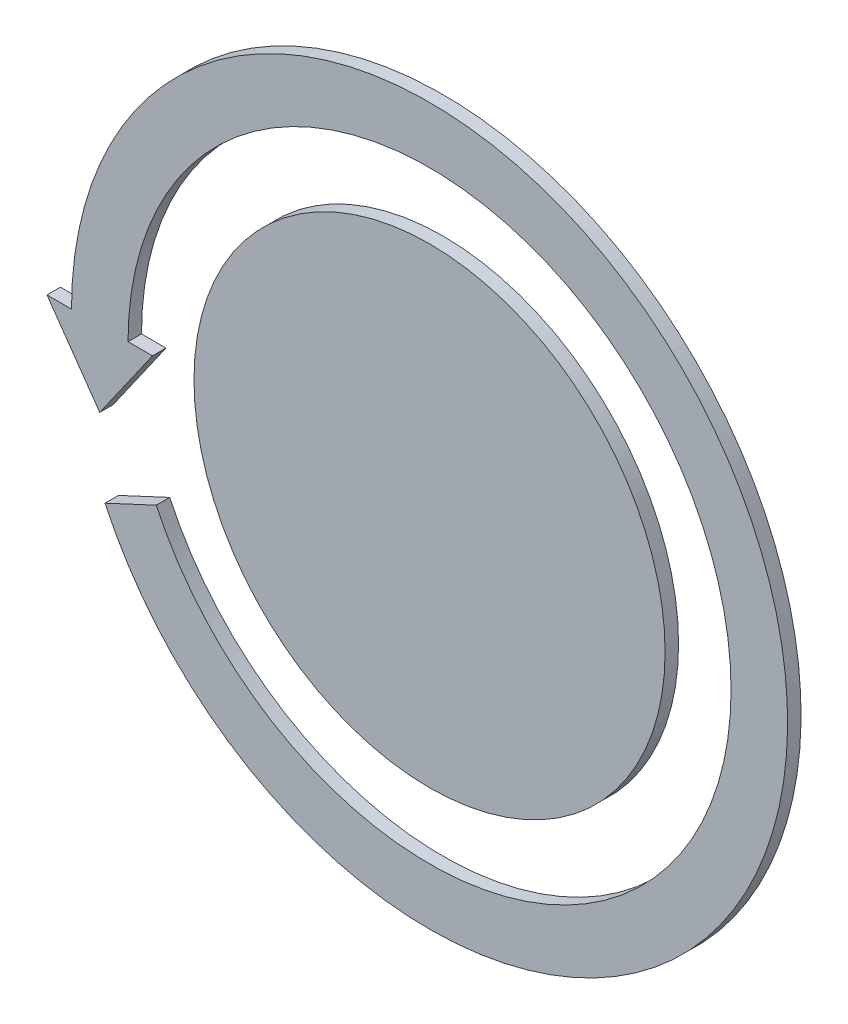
from build123d import *

# Parameters (mm, degrees)
SKIZZE1_R                         = 34.996592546
AUFSATZ_LINEAR_AUSTRAGEN1_DEPTH   = 2
AUFSATZ_LINEAR_AUSTRAGEN1_2_DEPTH = 2


with BuildPart() as part:
    # Skizze1 → Aufsatz-Linear austragen1 (new body)
    with BuildSketch(Plane.XY):
        Circle(SKIZZE1_R)
    extrude(amount=AUFSATZ_LINEAR_AUSTRAGEN1_DEPTH)


with BuildPart() as body_2:
    # Skizze1 → Aufsatz-Linear austragen1 2 (new body)
    with BuildSketch(Plane.XY):
        with BuildLine():
            Line((-40.598661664, -18.931466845), (-48.210863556, -22.481094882))
            ThreePointArc((-48.210863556, -22.481094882), (51.933873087, 11.513462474), (-53.194802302, 0))
            Line((-53.194802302, 0), (-56.834411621, 0))
            Line((-56.834411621, 0), (-48.995361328, -11.195582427))
            Line((-48.995361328, -11.195582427), (-41.156005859, 0))
            Line((-41.156005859, 0), (-44.79566682, 0))
            ThreePointArc((-44.79566682, 0), (43.733830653, 9.695556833), (-40.598661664, -18.931466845))
        make_face()
    extrude(amount=AUFSATZ_LINEAR_AUSTRAGEN1_2_DEPTH)


solid = Compound([part.part, body_2.part])
